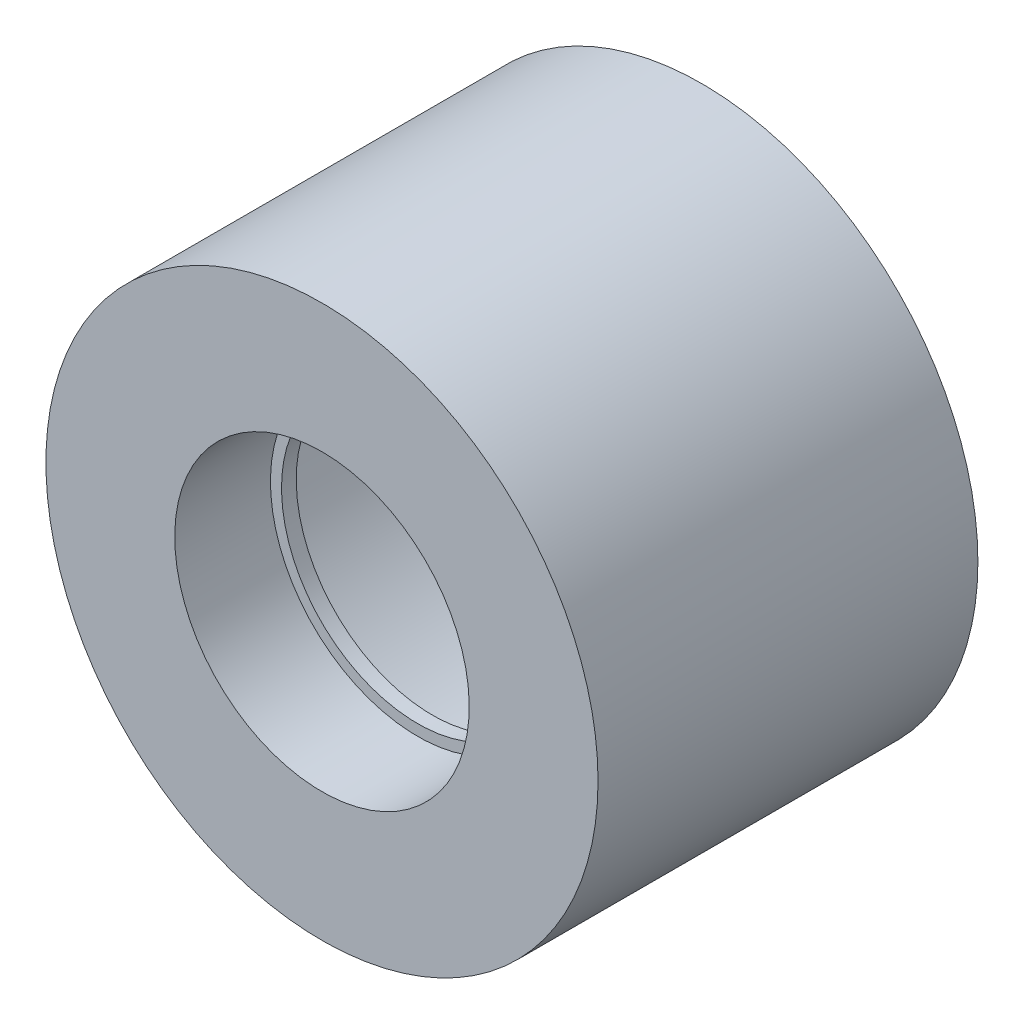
ISO-10303-21;
HEADER;
FILE_DESCRIPTION(('STEP AP214'),'2;1');
FILE_NAME('part.step','',(''),(''),'','','');
FILE_SCHEMA(('AUTOMOTIVE_DESIGN { 1 0 10303 214 1 1 1 1 }'));
ENDSEC;
DATA;
#1=APPLICATION_CONTEXT('core data for automotive mechanical design processes');
#2=APPLICATION_PROTOCOL_DEFINITION('international standard','automotive_design',2000,#1);
#3=PRODUCT_CONTEXT('',#1,'mechanical');
#4=PRODUCT('Part','Part','',(#3));
#5=PRODUCT_RELATED_PRODUCT_CATEGORY('part','',(#4));
#6=PRODUCT_DEFINITION_FORMATION('','',#4);
#7=PRODUCT_DEFINITION_CONTEXT('part definition',#1,'design');
#8=PRODUCT_DEFINITION('design','',#6,#7);
#9=PRODUCT_DEFINITION_SHAPE('','',#8);
#10=(LENGTH_UNIT() NAMED_UNIT(*) SI_UNIT(.MILLI.,.METRE.));
#11=(NAMED_UNIT(*) PLANE_ANGLE_UNIT() SI_UNIT($,.RADIAN.));
#12=(NAMED_UNIT(*) SI_UNIT($,.STERADIAN.) SOLID_ANGLE_UNIT());
#13=UNCERTAINTY_MEASURE_WITH_UNIT(LENGTH_MEASURE(1.E-05),#10,'distance_accuracy_value','');
#14=(GEOMETRIC_REPRESENTATION_CONTEXT(3) GLOBAL_UNCERTAINTY_ASSIGNED_CONTEXT((#13)) GLOBAL_UNIT_ASSIGNED_CONTEXT((#10,
#11,#12)) REPRESENTATION_CONTEXT('',''));
#15=CARTESIAN_POINT('',(0.,0.,0.));
#16=DIRECTION('',(0.,0.,1.));
#17=DIRECTION('',(1.,0.,0.));
#18=AXIS2_PLACEMENT_3D('',#15,#16,#17);
#19=CARTESIAN_POINT('',(-125.999987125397,-125.999987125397,7.));
#20=DIRECTION('',(0.,0.,-1.));
#21=DIRECTION('',(0.,1.,0.));
#22=AXIS2_PLACEMENT_3D('',#19,#20,#21);
#23=PLANE('',#22);
#24=CARTESIAN_POINT('',(1.2490009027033E-13,0.,7.));
#25=DIRECTION('',(0.,0.,-1.));
#26=DIRECTION('',(0.,1.,0.));
#27=AXIS2_PLACEMENT_3D('',#24,#25,#26);
#28=CIRCLE('',#27,107.5);
#29=CARTESIAN_POINT('',(107.5,0.,7.));
#30=VERTEX_POINT('',#29);
#31=EDGE_CURVE('E18',#30,#30,#28,.T.);
#32=ORIENTED_EDGE('',*,*,#31,.F.);
#33=EDGE_LOOP('',(#32));
#34=FACE_BOUND('',#33,.T.);
#35=CARTESIAN_POINT('',(0.,0.,7.));
#36=DIRECTION('',(0.,0.,-1.));
#37=DIRECTION('',(0.,1.,0.));
#38=AXIS2_PLACEMENT_3D('',#35,#36,#37);
#39=CIRCLE('',#38,120.);
#40=CARTESIAN_POINT('',(120.,0.,7.));
#41=VERTEX_POINT('',#40);
#42=EDGE_CURVE('E9',#41,#41,#39,.T.);
#43=ORIENTED_EDGE('',*,*,#42,.T.);
#44=EDGE_LOOP('',(#43));
#45=FACE_BOUND('',#44,.T.);
#46=ADVANCED_FACE('F14',(#34,#45),#23,.T.);
#47=CARTESIAN_POINT('',(0.,-1.20683358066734E-13,0.));
#48=DIRECTION('',(0.,0.,1.));
#49=DIRECTION('',(1.,0.,0.));
#50=AXIS2_PLACEMENT_3D('',#47,#48,#49);
#51=CYLINDRICAL_SURFACE('',#50,120.);
#52=CARTESIAN_POINT('',(0.,-1.20683358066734E-13,0.));
#53=DIRECTION('',(0.,0.,1.));
#54=DIRECTION('',(1.,0.,0.));
#55=AXIS2_PLACEMENT_3D('',#52,#53,#54);
#56=CIRCLE('',#55,120.);
#57=CARTESIAN_POINT('',(120.,0.,0.));
#58=VERTEX_POINT('',#57);
#59=EDGE_CURVE('E231',#58,#58,#56,.T.);
#60=ORIENTED_EDGE('',*,*,#59,.F.);
#61=DIRECTION('',(0.,0.,1.));
#62=VECTOR('',#61,1.);
#63=CARTESIAN_POINT('',(120.,0.,3.5));
#64=LINE('',#63,#62);
#65=EDGE_CURVE('E24',#58,#41,#64,.T.);
#66=ORIENTED_EDGE('',*,*,#65,.T.);
#67=ORIENTED_EDGE('',*,*,#42,.F.);
#68=ORIENTED_EDGE('',*,*,#65,.F.);
#69=EDGE_LOOP('',(#60,#66,#67,#68));
#70=FACE_BOUND('',#69,.T.);
#71=ADVANCED_FACE('F105',(#70),#51,.F.);
#72=CARTESIAN_POINT('',(-196.874991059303,196.874991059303,0.));
#73=DIRECTION('',(0.,0.,-1.));
#74=DIRECTION('',(1.,0.,0.));
#75=AXIS2_PLACEMENT_3D('',#72,#73,#74);
#76=PLANE('',#75);
#77=ORIENTED_EDGE('',*,*,#59,.T.);
#78=EDGE_LOOP('',(#77));
#79=FACE_BOUND('',#78,.T.);
#80=CARTESIAN_POINT('',(0.,0.,0.));
#81=DIRECTION('',(0.,0.,1.));
#82=DIRECTION('',(1.,0.,0.));
#83=AXIS2_PLACEMENT_3D('',#80,#81,#82);
#84=CIRCLE('',#83,187.5);
#85=CARTESIAN_POINT('',(187.5,0.,0.));
#86=VERTEX_POINT('',#85);
#87=EDGE_CURVE('E228',#86,#86,#84,.T.);
#88=ORIENTED_EDGE('',*,*,#87,.F.);
#89=EDGE_LOOP('',(#88));
#90=FACE_BOUND('',#89,.T.);
#91=ADVANCED_FACE('F110',(#79,#90),#76,.T.);
#92=CARTESIAN_POINT('',(0.,0.,0.));
#93=DIRECTION('',(0.,0.,1.));
#94=DIRECTION('',(1.,0.,0.));
#95=AXIS2_PLACEMENT_3D('',#92,#93,#94);
#96=CYLINDRICAL_SURFACE('',#95,187.5);
#97=ORIENTED_EDGE('',*,*,#87,.T.);
#98=DIRECTION('',(0.,0.,-1.));
#99=VECTOR('',#98,1.);
#100=CARTESIAN_POINT('',(187.5,0.,129.));
#101=LINE('',#100,#99);
#102=CARTESIAN_POINT('',(187.5,0.,258.));
#103=VERTEX_POINT('',#102);
#104=EDGE_CURVE('E223',#103,#86,#101,.T.);
#105=ORIENTED_EDGE('',*,*,#104,.F.);
#106=CARTESIAN_POINT('',(1.52655665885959E-13,1.69255615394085E-13,258.));
#107=DIRECTION('',(0.,0.,-1.));
#108=DIRECTION('',(0.,1.,0.));
#109=AXIS2_PLACEMENT_3D('',#106,#107,#108);
#110=CIRCLE('',#109,187.5);
#111=EDGE_CURVE('E225',#103,#103,#110,.T.);
#112=ORIENTED_EDGE('',*,*,#111,.T.);
#113=ORIENTED_EDGE('',*,*,#104,.T.);
#114=EDGE_LOOP('',(#97,#105,#112,#113));
#115=FACE_BOUND('',#114,.T.);
#116=ADVANCED_FACE('F117',(#115),#96,.T.);
#117=CARTESIAN_POINT('',(196.874991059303,-196.874991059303,258.));
#118=DIRECTION('',(0.,0.,1.));
#119=DIRECTION('',(0.,1.,0.));
#120=AXIS2_PLACEMENT_3D('',#117,#118,#119);
#121=PLANE('',#120);
#122=CARTESIAN_POINT('',(0.,2.60208521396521E-13,258.));
#123=DIRECTION('',(0.,0.,-1.));
#124=DIRECTION('',(-1.,0.,0.));
#125=AXIS2_PLACEMENT_3D('',#122,#123,#124);
#126=CIRCLE('',#125,100.);
#127=CARTESIAN_POINT('',(0.,100.,258.));
#128=VERTEX_POINT('',#127);
#129=EDGE_CURVE('E220',#128,#128,#126,.T.);
#130=ORIENTED_EDGE('',*,*,#129,.T.);
#131=EDGE_LOOP('',(#130));
#132=FACE_BOUND('',#131,.T.);
#133=ORIENTED_EDGE('',*,*,#111,.F.);
#134=EDGE_LOOP('',(#133));
#135=FACE_BOUND('',#134,.T.);
#136=ADVANCED_FACE('F121',(#132,#135),#121,.T.);
#137=CARTESIAN_POINT('',(0.,2.60208521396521E-13,258.));
#138=DIRECTION('',(0.,0.,-1.));
#139=DIRECTION('',(-1.,0.,0.));
#140=AXIS2_PLACEMENT_3D('',#137,#138,#139);
#141=CYLINDRICAL_SURFACE('',#140,100.);
#142=ORIENTED_EDGE('',*,*,#129,.F.);
#143=DIRECTION('',(0.,0.,-1.));
#144=VECTOR('',#143,1.);
#145=CARTESIAN_POINT('',(0.,100.,225.5));
#146=LINE('',#145,#144);
#147=CARTESIAN_POINT('',(0.,100.,193.));
#148=VERTEX_POINT('',#147);
#149=EDGE_CURVE('E53',#128,#148,#146,.T.);
#150=ORIENTED_EDGE('',*,*,#149,.T.);
#151=CARTESIAN_POINT('',(0.,1.38777878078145E-13,193.));
#152=DIRECTION('',(0.,0.,1.));
#153=DIRECTION('',(1.,0.,0.));
#154=AXIS2_PLACEMENT_3D('',#151,#152,#153);
#155=CIRCLE('',#154,100.);
#156=EDGE_CURVE('E58',#148,#148,#155,.T.);
#157=ORIENTED_EDGE('',*,*,#156,.F.);
#158=ORIENTED_EDGE('',*,*,#149,.F.);
#159=EDGE_LOOP('',(#142,#150,#157,#158));
#160=FACE_BOUND('',#159,.T.);
#161=ADVANCED_FACE('F125',(#160),#141,.F.);
#162=CARTESIAN_POINT('',(-104.999996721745,-104.999996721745,193.));
#163=DIRECTION('',(0.,0.,1.));
#164=DIRECTION('',(1.,0.,0.));
#165=AXIS2_PLACEMENT_3D('',#162,#163,#164);
#166=PLANE('',#165);
#167=CARTESIAN_POINT('',(1.27334623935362E-13,2.32452945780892E-13,193.));
#168=DIRECTION('',(0.,0.,1.));
#169=DIRECTION('',(1.,0.,0.));
#170=AXIS2_PLACEMENT_3D('',#167,#168,#169);
#171=CIRCLE('',#170,92.5);
#172=CARTESIAN_POINT('',(0.,92.5000000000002,193.));
#173=VERTEX_POINT('',#172);
#174=EDGE_CURVE('E215',#173,#173,#171,.T.);
#175=ORIENTED_EDGE('',*,*,#174,.F.);
#176=EDGE_LOOP('',(#175));
#177=FACE_BOUND('',#176,.T.);
#178=ORIENTED_EDGE('',*,*,#156,.T.);
#179=EDGE_LOOP('',(#178));
#180=FACE_BOUND('',#179,.T.);
#181=ADVANCED_FACE('F129',(#177,#180),#166,.T.);
#182=CARTESIAN_POINT('',(0.,1.66533453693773E-13,193.));
#183=DIRECTION('',(0.,0.,-1.));
#184=DIRECTION('',(-1.,0.,0.));
#185=AXIS2_PLACEMENT_3D('',#182,#183,#184);
#186=CYLINDRICAL_SURFACE('',#185,92.5);
#187=ORIENTED_EDGE('',*,*,#174,.T.);
#188=DIRECTION('',(0.,0.,1.));
#189=VECTOR('',#188,1.);
#190=CARTESIAN_POINT('',(0.,92.5000000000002,188.));
#191=LINE('',#190,#189);
#192=CARTESIAN_POINT('',(0.,92.5000000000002,183.));
#193=VERTEX_POINT('',#192);
#194=EDGE_CURVE('E80',#193,#173,#191,.T.);
#195=ORIENTED_EDGE('',*,*,#194,.F.);
#196=CARTESIAN_POINT('',(1.27334623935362E-13,2.32452945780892E-13,183.));
#197=DIRECTION('',(0.,0.,1.));
#198=DIRECTION('',(1.,0.,0.));
#199=AXIS2_PLACEMENT_3D('',#196,#197,#198);
#200=CIRCLE('',#199,92.5);
#201=EDGE_CURVE('E69',#193,#193,#200,.T.);
#202=ORIENTED_EDGE('',*,*,#201,.F.);
#203=ORIENTED_EDGE('',*,*,#194,.T.);
#204=EDGE_LOOP('',(#187,#195,#202,#203));
#205=FACE_BOUND('',#204,.T.);
#206=ADVANCED_FACE('F132',(#205),#186,.F.);
#207=CARTESIAN_POINT('',(-183.749988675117,-183.749988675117,183.));
#208=DIRECTION('',(0.,0.,-1.));
#209=DIRECTION('',(0.,1.,0.));
#210=AXIS2_PLACEMENT_3D('',#207,#208,#209);
#211=PLANE('',#210);
#212=ORIENTED_EDGE('',*,*,#201,.T.);
#213=EDGE_LOOP('',(#212));
#214=FACE_BOUND('',#213,.T.);
#215=CARTESIAN_POINT('',(1.2490009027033E-13,1.89497053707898E-13,183.));
#216=DIRECTION('',(0.,0.,-1.));
#217=DIRECTION('',(0.,1.,0.));
#218=AXIS2_PLACEMENT_3D('',#215,#216,#217);
#219=CIRCLE('',#218,175.);
#220=CARTESIAN_POINT('',(175.,1.526557E-13,183.));
#221=VERTEX_POINT('',#220);
#222=EDGE_CURVE('E75',#221,#221,#219,.T.);
#223=ORIENTED_EDGE('',*,*,#222,.T.);
#224=EDGE_LOOP('',(#223));
#225=FACE_BOUND('',#224,.T.);
#226=ADVANCED_FACE('F102',(#214,#225),#211,.T.);
#227=CARTESIAN_POINT('',(1.2490009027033E-13,1.89497053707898E-13,183.));
#228=DIRECTION('',(0.,0.,-1.));
#229=DIRECTION('',(0.,1.,0.));
#230=AXIS2_PLACEMENT_3D('',#227,#228,#229);
#231=CYLINDRICAL_SURFACE('',#230,175.);
#232=ORIENTED_EDGE('',*,*,#222,.F.);
#233=DIRECTION('',(0.,0.,1.));
#234=VECTOR('',#233,1.);
#235=CARTESIAN_POINT('',(175.,1.526557E-13,116.5));
#236=LINE('',#235,#234);
#237=CARTESIAN_POINT('',(175.,1.526557E-13,50.));
#238=VERTEX_POINT('',#237);
#239=EDGE_CURVE('E77',#238,#221,#236,.T.);
#240=ORIENTED_EDGE('',*,*,#239,.F.);
#241=CARTESIAN_POINT('',(0.,0.,50.));
#242=DIRECTION('',(0.,0.,1.));
#243=DIRECTION('',(0.,-1.,0.));
#244=AXIS2_PLACEMENT_3D('',#241,#242,#243);
#245=CIRCLE('',#244,175.);
#246=EDGE_CURVE('E82',#238,#238,#245,.T.);
#247=ORIENTED_EDGE('',*,*,#246,.F.);
#248=ORIENTED_EDGE('',*,*,#239,.T.);
#249=EDGE_LOOP('',(#232,#240,#247,#248));
#250=FACE_BOUND('',#249,.T.);
#251=ADVANCED_FACE('F76',(#250),#231,.F.);
#252=CARTESIAN_POINT('',(183.749988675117,183.749988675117,50.));
#253=DIRECTION('',(0.,0.,1.));
#254=DIRECTION('',(-1.,0.,0.));
#255=AXIS2_PLACEMENT_3D('',#252,#253,#254);
#256=PLANE('',#255);
#257=CARTESIAN_POINT('',(0.,0.,50.));
#258=DIRECTION('',(0.,0.,1.));
#259=DIRECTION('',(0.,-1.,0.));
#260=AXIS2_PLACEMENT_3D('',#257,#258,#259);
#261=CIRCLE('',#260,107.5);
#262=CARTESIAN_POINT('',(107.5,0.,50.));
#263=VERTEX_POINT('',#262);
#264=EDGE_CURVE('E88',#263,#263,#261,.T.);
#265=ORIENTED_EDGE('',*,*,#264,.F.);
#266=EDGE_LOOP('',(#265));
#267=FACE_BOUND('',#266,.T.);
#268=ORIENTED_EDGE('',*,*,#246,.T.);
#269=EDGE_LOOP('',(#268));
#270=FACE_BOUND('',#269,.T.);
#271=ADVANCED_FACE('F94',(#267,#270),#256,.T.);
#272=CARTESIAN_POINT('',(0.,0.,7.));
#273=DIRECTION('',(0.,0.,1.));
#274=DIRECTION('',(0.,-1.,0.));
#275=AXIS2_PLACEMENT_3D('',#272,#273,#274);
#276=CYLINDRICAL_SURFACE('',#275,107.5);
#277=ORIENTED_EDGE('',*,*,#264,.T.);
#278=DIRECTION('',(0.,0.,-1.));
#279=VECTOR('',#278,1.);
#280=CARTESIAN_POINT('',(107.5,0.,28.5));
#281=LINE('',#280,#279);
#282=EDGE_CURVE('E90',#263,#30,#281,.T.);
#283=ORIENTED_EDGE('',*,*,#282,.T.);
#284=ORIENTED_EDGE('',*,*,#31,.T.);
#285=ORIENTED_EDGE('',*,*,#282,.F.);
#286=EDGE_LOOP('',(#277,#283,#284,#285));
#287=FACE_BOUND('',#286,.T.);
#288=ADVANCED_FACE('F16',(#287),#276,.F.);
#289=CLOSED_SHELL('',(#46,#71,#91,#116,#136,#161,#181,#206,#226,#251,#271,#288));
#290=MANIFOLD_SOLID_BREP('B1',#289);
#291=ADVANCED_BREP_SHAPE_REPRESENTATION('',(#18,#290),#14);
#292=SHAPE_DEFINITION_REPRESENTATION(#9,#291);
ENDSEC;
END-ISO-10303-21;
